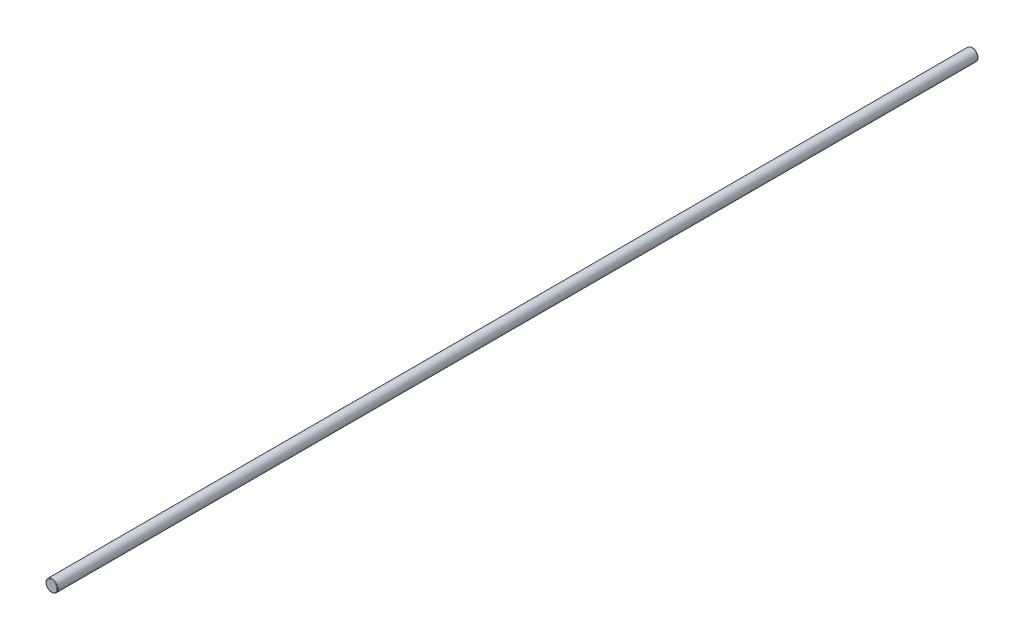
from build123d import *

# Parameters (mm, degrees)
ESQUISSE1_R      = 2.25
EXTRUSION1_DEPTH = 349
CONG_1_R         = 0.2


with BuildPart() as part:
    # Esquisse1 → Extrusion1 (new body)
    with BuildSketch(Plane.XY):
        Circle(ESQUISSE1_R)
    extrude(amount=EXTRUSION1_DEPTH)

    # Cong_1
    cong_1_edges = [part.edges().sort_by_distance(p)[0] for p in [
        (-2.25, 0, 0),
        (-2.25, 0, 349),
    ]]
    fillet(cong_1_edges, radius=CONG_1_R)


solid = part.part
